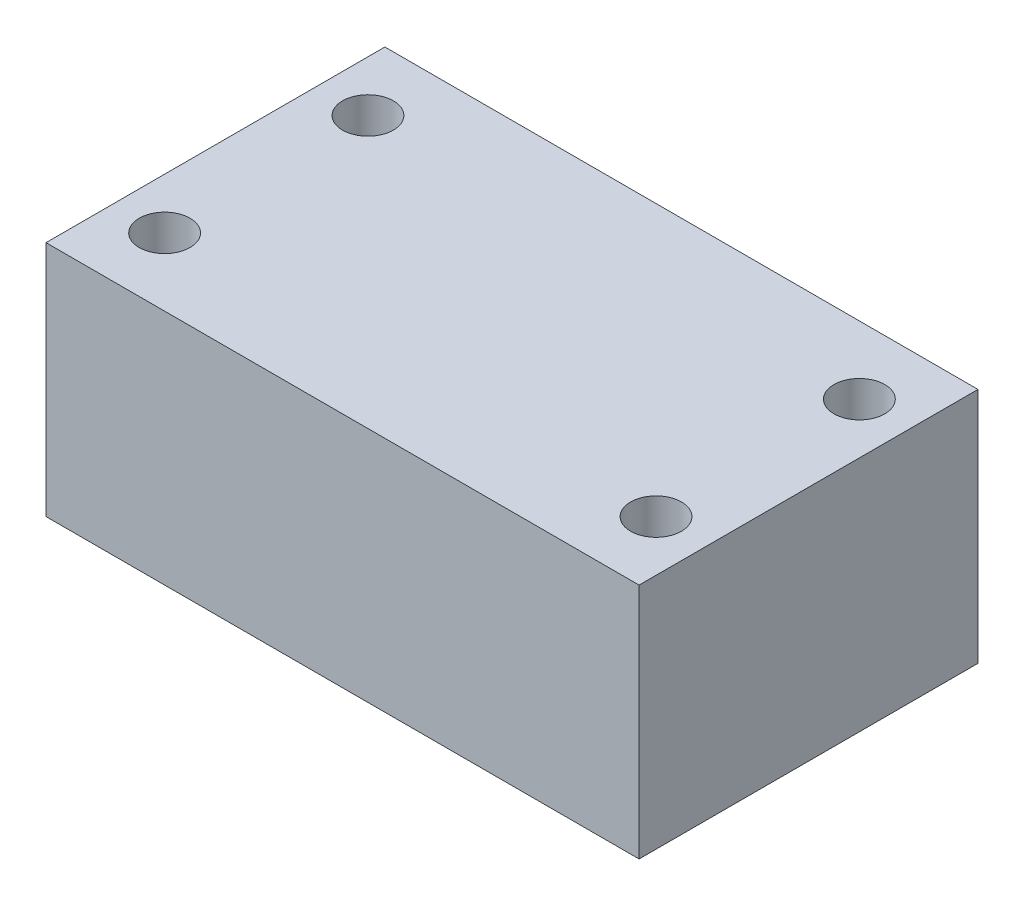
ISO-10303-21;
HEADER;
FILE_DESCRIPTION(('STEP AP214'),'2;1');
FILE_NAME('part.step','',(''),(''),'','','');
FILE_SCHEMA(('AUTOMOTIVE_DESIGN { 1 0 10303 214 1 1 1 1 }'));
ENDSEC;
DATA;
#1=APPLICATION_CONTEXT('core data for automotive mechanical design processes');
#2=APPLICATION_PROTOCOL_DEFINITION('international standard','automotive_design',2000,#1);
#3=PRODUCT_CONTEXT('',#1,'mechanical');
#4=PRODUCT('Part','Part','',(#3));
#5=PRODUCT_RELATED_PRODUCT_CATEGORY('part','',(#4));
#6=PRODUCT_DEFINITION_FORMATION('','',#4);
#7=PRODUCT_DEFINITION_CONTEXT('part definition',#1,'design');
#8=PRODUCT_DEFINITION('design','',#6,#7);
#9=PRODUCT_DEFINITION_SHAPE('','',#8);
#10=(LENGTH_UNIT() NAMED_UNIT(*) SI_UNIT(.MILLI.,.METRE.));
#11=(NAMED_UNIT(*) PLANE_ANGLE_UNIT() SI_UNIT($,.RADIAN.));
#12=(NAMED_UNIT(*) SI_UNIT($,.STERADIAN.) SOLID_ANGLE_UNIT());
#13=UNCERTAINTY_MEASURE_WITH_UNIT(LENGTH_MEASURE(1.E-05),#10,'distance_accuracy_value','');
#14=(GEOMETRIC_REPRESENTATION_CONTEXT(3) GLOBAL_UNCERTAINTY_ASSIGNED_CONTEXT((#13)) GLOBAL_UNIT_ASSIGNED_CONTEXT((#10,
#11,#12)) REPRESENTATION_CONTEXT('',''));
#15=CARTESIAN_POINT('',(0.,0.,0.));
#16=DIRECTION('',(0.,0.,1.));
#17=DIRECTION('',(1.,0.,0.));
#18=AXIS2_PLACEMENT_3D('',#15,#16,#17);
#19=CARTESIAN_POINT('',(0.,0.,0.));
#20=DIRECTION('',(0.,-1.,0.));
#21=DIRECTION('',(0.,0.,-1.));
#22=AXIS2_PLACEMENT_3D('',#19,#20,#21);
#23=PLANE('',#22);
#24=DIRECTION('',(0.,0.,-1.));
#25=VECTOR('',#24,1.);
#26=CARTESIAN_POINT('',(-35.,0.,20.));
#27=LINE('',#26,#25);
#28=CARTESIAN_POINT('',(-35.,0.,20.));
#29=VERTEX_POINT('',#28);
#30=CARTESIAN_POINT('',(-35.,0.,-20.));
#31=VERTEX_POINT('',#30);
#32=EDGE_CURVE('E55',#29,#31,#27,.T.);
#33=ORIENTED_EDGE('',*,*,#32,.T.);
#34=DIRECTION('',(1.,0.,0.));
#35=VECTOR('',#34,1.);
#36=CARTESIAN_POINT('',(-35.,0.,-20.));
#37=LINE('',#36,#35);
#38=CARTESIAN_POINT('',(35.,0.,-20.));
#39=VERTEX_POINT('',#38);
#40=EDGE_CURVE('E220',#31,#39,#37,.T.);
#41=ORIENTED_EDGE('',*,*,#40,.T.);
#42=DIRECTION('',(0.,0.,1.));
#43=VECTOR('',#42,1.);
#44=CARTESIAN_POINT('',(35.,0.,20.));
#45=LINE('',#44,#43);
#46=CARTESIAN_POINT('',(35.,0.,20.));
#47=VERTEX_POINT('',#46);
#48=EDGE_CURVE('E60',#39,#47,#45,.T.);
#49=ORIENTED_EDGE('',*,*,#48,.T.);
#50=DIRECTION('',(-1.,0.,0.));
#51=VECTOR('',#50,1.);
#52=CARTESIAN_POINT('',(-35.,0.,20.));
#53=LINE('',#52,#51);
#54=EDGE_CURVE('E58',#47,#29,#53,.T.);
#55=ORIENTED_EDGE('',*,*,#54,.T.);
#56=EDGE_LOOP('',(#33,#41,#49,#55));
#57=FACE_BOUND('',#56,.T.);
#58=CARTESIAN_POINT('',(-29.,0.,-12.));
#59=DIRECTION('',(0.,1.,0.));
#60=DIRECTION('',(0.,0.,1.));
#61=AXIS2_PLACEMENT_3D('',#58,#59,#60);
#62=CIRCLE('',#61,3.);
#63=CARTESIAN_POINT('',(-29.,0.,-9.));
#64=VERTEX_POINT('',#63);
#65=EDGE_CURVE('E66',#64,#64,#62,.T.);
#66=ORIENTED_EDGE('',*,*,#65,.T.);
#67=EDGE_LOOP('',(#66));
#68=FACE_BOUND('',#67,.T.);
#69=CARTESIAN_POINT('',(-29.,0.,12.));
#70=DIRECTION('',(0.,1.,0.));
#71=DIRECTION('',(0.,0.,1.));
#72=AXIS2_PLACEMENT_3D('',#69,#70,#71);
#73=CIRCLE('',#72,3.);
#74=CARTESIAN_POINT('',(-29.,0.,15.));
#75=VERTEX_POINT('',#74);
#76=EDGE_CURVE('E95',#75,#75,#73,.T.);
#77=ORIENTED_EDGE('',*,*,#76,.T.);
#78=EDGE_LOOP('',(#77));
#79=FACE_BOUND('',#78,.T.);
#80=CARTESIAN_POINT('',(29.,0.,-12.));
#81=DIRECTION('',(0.,1.,0.));
#82=DIRECTION('',(0.,0.,1.));
#83=AXIS2_PLACEMENT_3D('',#80,#81,#82);
#84=CIRCLE('',#83,3.);
#85=CARTESIAN_POINT('',(29.,0.,-9.));
#86=VERTEX_POINT('',#85);
#87=EDGE_CURVE('E97',#86,#86,#84,.T.);
#88=ORIENTED_EDGE('',*,*,#87,.T.);
#89=EDGE_LOOP('',(#88));
#90=FACE_BOUND('',#89,.T.);
#91=CARTESIAN_POINT('',(29.,0.,12.));
#92=DIRECTION('',(0.,1.,0.));
#93=DIRECTION('',(0.,0.,1.));
#94=AXIS2_PLACEMENT_3D('',#91,#92,#93);
#95=CIRCLE('',#94,3.);
#96=CARTESIAN_POINT('',(29.,0.,15.));
#97=VERTEX_POINT('',#96);
#98=EDGE_CURVE('E20',#97,#97,#95,.T.);
#99=ORIENTED_EDGE('',*,*,#98,.T.);
#100=EDGE_LOOP('',(#99));
#101=FACE_BOUND('',#100,.T.);
#102=ADVANCED_FACE('F17',(#57,#68,#79,#90,#101),#23,.T.);
#103=CARTESIAN_POINT('',(29.,0.,12.));
#104=DIRECTION('',(0.,1.,0.));
#105=DIRECTION('',(0.,0.,1.));
#106=AXIS2_PLACEMENT_3D('',#103,#104,#105);
#107=CYLINDRICAL_SURFACE('',#106,3.);
#108=ORIENTED_EDGE('',*,*,#98,.F.);
#109=EDGE_LOOP('',(#108));
#110=FACE_BOUND('',#109,.T.);
#111=CARTESIAN_POINT('',(29.,28.,12.));
#112=DIRECTION('',(0.,1.,0.));
#113=DIRECTION('',(0.,0.,1.));
#114=AXIS2_PLACEMENT_3D('',#111,#112,#113);
#115=CIRCLE('',#114,3.);
#116=CARTESIAN_POINT('',(29.,28.,15.));
#117=VERTEX_POINT('',#116);
#118=EDGE_CURVE('E90',#117,#117,#115,.T.);
#119=ORIENTED_EDGE('',*,*,#118,.T.);
#120=EDGE_LOOP('',(#119));
#121=FACE_BOUND('',#120,.T.);
#122=ADVANCED_FACE('F105',(#110,#121),#107,.F.);
#123=CARTESIAN_POINT('',(29.,0.,-12.));
#124=DIRECTION('',(0.,1.,0.));
#125=DIRECTION('',(0.,0.,1.));
#126=AXIS2_PLACEMENT_3D('',#123,#124,#125);
#127=CYLINDRICAL_SURFACE('',#126,3.);
#128=ORIENTED_EDGE('',*,*,#87,.F.);
#129=EDGE_LOOP('',(#128));
#130=FACE_BOUND('',#129,.T.);
#131=CARTESIAN_POINT('',(29.,28.,-12.));
#132=DIRECTION('',(0.,1.,0.));
#133=DIRECTION('',(0.,0.,1.));
#134=AXIS2_PLACEMENT_3D('',#131,#132,#133);
#135=CIRCLE('',#134,3.);
#136=CARTESIAN_POINT('',(29.,28.,-9.));
#137=VERTEX_POINT('',#136);
#138=EDGE_CURVE('E87',#137,#137,#135,.T.);
#139=ORIENTED_EDGE('',*,*,#138,.T.);
#140=EDGE_LOOP('',(#139));
#141=FACE_BOUND('',#140,.T.);
#142=ADVANCED_FACE('F108',(#130,#141),#127,.F.);
#143=CARTESIAN_POINT('',(-29.,0.,12.));
#144=DIRECTION('',(0.,1.,0.));
#145=DIRECTION('',(0.,0.,1.));
#146=AXIS2_PLACEMENT_3D('',#143,#144,#145);
#147=CYLINDRICAL_SURFACE('',#146,3.);
#148=ORIENTED_EDGE('',*,*,#76,.F.);
#149=EDGE_LOOP('',(#148));
#150=FACE_BOUND('',#149,.T.);
#151=CARTESIAN_POINT('',(-29.,28.,12.));
#152=DIRECTION('',(0.,1.,0.));
#153=DIRECTION('',(0.,0.,1.));
#154=AXIS2_PLACEMENT_3D('',#151,#152,#153);
#155=CIRCLE('',#154,3.);
#156=CARTESIAN_POINT('',(-29.,28.,15.));
#157=VERTEX_POINT('',#156);
#158=EDGE_CURVE('E84',#157,#157,#155,.T.);
#159=ORIENTED_EDGE('',*,*,#158,.T.);
#160=EDGE_LOOP('',(#159));
#161=FACE_BOUND('',#160,.T.);
#162=ADVANCED_FACE('F135',(#150,#161),#147,.F.);
#163=CARTESIAN_POINT('',(-29.,0.,-12.));
#164=DIRECTION('',(0.,1.,0.));
#165=DIRECTION('',(0.,0.,1.));
#166=AXIS2_PLACEMENT_3D('',#163,#164,#165);
#167=CYLINDRICAL_SURFACE('',#166,3.);
#168=ORIENTED_EDGE('',*,*,#65,.F.);
#169=EDGE_LOOP('',(#168));
#170=FACE_BOUND('',#169,.T.);
#171=CARTESIAN_POINT('',(-29.,28.,-12.));
#172=DIRECTION('',(0.,1.,0.));
#173=DIRECTION('',(0.,0.,1.));
#174=AXIS2_PLACEMENT_3D('',#171,#172,#173);
#175=CIRCLE('',#174,3.);
#176=CARTESIAN_POINT('',(-29.,28.,-9.));
#177=VERTEX_POINT('',#176);
#178=EDGE_CURVE('E81',#177,#177,#175,.T.);
#179=ORIENTED_EDGE('',*,*,#178,.T.);
#180=EDGE_LOOP('',(#179));
#181=FACE_BOUND('',#180,.T.);
#182=ADVANCED_FACE('F132',(#170,#181),#167,.F.);
#183=CARTESIAN_POINT('',(-35.,28.,20.));
#184=DIRECTION('',(0.,0.,-1.));
#185=DIRECTION('',(-1.,0.,0.));
#186=AXIS2_PLACEMENT_3D('',#183,#184,#185);
#187=PLANE('',#186);
#188=DIRECTION('',(0.,1.,0.));
#189=VECTOR('',#188,1.);
#190=CARTESIAN_POINT('',(35.,28.,20.));
#191=LINE('',#190,#189);
#192=CARTESIAN_POINT('',(35.,28.,20.));
#193=VERTEX_POINT('',#192);
#194=EDGE_CURVE('E228',#47,#193,#191,.T.);
#195=ORIENTED_EDGE('',*,*,#194,.T.);
#196=DIRECTION('',(1.,0.,0.));
#197=VECTOR('',#196,1.);
#198=CARTESIAN_POINT('',(0.,28.,20.));
#199=LINE('',#198,#197);
#200=CARTESIAN_POINT('',(-35.,28.,20.));
#201=VERTEX_POINT('',#200);
#202=EDGE_CURVE('E77',#193,#201,#199,.F.);
#203=ORIENTED_EDGE('',*,*,#202,.T.);
#204=DIRECTION('',(0.,1.,0.));
#205=VECTOR('',#204,1.);
#206=CARTESIAN_POINT('',(-35.,28.,20.));
#207=LINE('',#206,#205);
#208=EDGE_CURVE('E65',#201,#29,#207,.F.);
#209=ORIENTED_EDGE('',*,*,#208,.T.);
#210=ORIENTED_EDGE('',*,*,#54,.F.);
#211=EDGE_LOOP('',(#195,#203,#209,#210));
#212=FACE_BOUND('',#211,.T.);
#213=ADVANCED_FACE('F76',(#212),#187,.F.);
#214=CARTESIAN_POINT('',(-35.,28.,20.));
#215=DIRECTION('',(1.,0.,0.));
#216=DIRECTION('',(0.,0.,-1.));
#217=AXIS2_PLACEMENT_3D('',#214,#215,#216);
#218=PLANE('',#217);
#219=ORIENTED_EDGE('',*,*,#208,.F.);
#220=DIRECTION('',(0.,0.,-1.));
#221=VECTOR('',#220,1.);
#222=CARTESIAN_POINT('',(-35.,28.,0.));
#223=LINE('',#222,#221);
#224=CARTESIAN_POINT('',(-35.,28.,-20.));
#225=VERTEX_POINT('',#224);
#226=EDGE_CURVE('E221',#201,#225,#223,.T.);
#227=ORIENTED_EDGE('',*,*,#226,.T.);
#228=DIRECTION('',(0.,1.,0.));
#229=VECTOR('',#228,1.);
#230=CARTESIAN_POINT('',(-35.,28.,-20.));
#231=LINE('',#230,#229);
#232=EDGE_CURVE('E73',#225,#31,#231,.F.);
#233=ORIENTED_EDGE('',*,*,#232,.T.);
#234=ORIENTED_EDGE('',*,*,#32,.F.);
#235=EDGE_LOOP('',(#219,#227,#233,#234));
#236=FACE_BOUND('',#235,.T.);
#237=ADVANCED_FACE('F70',(#236),#218,.F.);
#238=CARTESIAN_POINT('',(-35.,28.,-20.));
#239=DIRECTION('',(0.,0.,1.));
#240=DIRECTION('',(1.,0.,0.));
#241=AXIS2_PLACEMENT_3D('',#238,#239,#240);
#242=PLANE('',#241);
#243=ORIENTED_EDGE('',*,*,#232,.F.);
#244=DIRECTION('',(1.,0.,0.));
#245=VECTOR('',#244,1.);
#246=CARTESIAN_POINT('',(0.,28.,-20.));
#247=LINE('',#246,#245);
#248=CARTESIAN_POINT('',(35.,28.,-20.));
#249=VERTEX_POINT('',#248);
#250=EDGE_CURVE('E26',#225,#249,#247,.T.);
#251=ORIENTED_EDGE('',*,*,#250,.T.);
#252=DIRECTION('',(0.,1.,0.));
#253=VECTOR('',#252,1.);
#254=CARTESIAN_POINT('',(35.,28.,-20.));
#255=LINE('',#254,#253);
#256=EDGE_CURVE('E34',#249,#39,#255,.F.);
#257=ORIENTED_EDGE('',*,*,#256,.T.);
#258=ORIENTED_EDGE('',*,*,#40,.F.);
#259=EDGE_LOOP('',(#243,#251,#257,#258));
#260=FACE_BOUND('',#259,.T.);
#261=ADVANCED_FACE('F120',(#260),#242,.F.);
#262=CARTESIAN_POINT('',(35.,28.,20.));
#263=DIRECTION('',(-1.,0.,0.));
#264=DIRECTION('',(0.,0.,1.));
#265=AXIS2_PLACEMENT_3D('',#262,#263,#264);
#266=PLANE('',#265);
#267=ORIENTED_EDGE('',*,*,#256,.F.);
#268=DIRECTION('',(0.,0.,-1.));
#269=VECTOR('',#268,1.);
#270=CARTESIAN_POINT('',(35.,28.,0.));
#271=LINE('',#270,#269);
#272=EDGE_CURVE('E11',#249,#193,#271,.F.);
#273=ORIENTED_EDGE('',*,*,#272,.T.);
#274=ORIENTED_EDGE('',*,*,#194,.F.);
#275=ORIENTED_EDGE('',*,*,#48,.F.);
#276=EDGE_LOOP('',(#267,#273,#274,#275));
#277=FACE_BOUND('',#276,.T.);
#278=ADVANCED_FACE('F113',(#277),#266,.F.);
#279=CARTESIAN_POINT('',(0.,28.,0.));
#280=DIRECTION('',(0.,-1.,0.));
#281=DIRECTION('',(0.,0.,-1.));
#282=AXIS2_PLACEMENT_3D('',#279,#280,#281);
#283=PLANE('',#282);
#284=ORIENTED_EDGE('',*,*,#250,.F.);
#285=ORIENTED_EDGE('',*,*,#226,.F.);
#286=ORIENTED_EDGE('',*,*,#202,.F.);
#287=ORIENTED_EDGE('',*,*,#272,.F.);
#288=EDGE_LOOP('',(#284,#285,#286,#287));
#289=FACE_BOUND('',#288,.T.);
#290=ORIENTED_EDGE('',*,*,#178,.F.);
#291=EDGE_LOOP('',(#290));
#292=FACE_BOUND('',#291,.T.);
#293=ORIENTED_EDGE('',*,*,#158,.F.);
#294=EDGE_LOOP('',(#293));
#295=FACE_BOUND('',#294,.T.);
#296=ORIENTED_EDGE('',*,*,#138,.F.);
#297=EDGE_LOOP('',(#296));
#298=FACE_BOUND('',#297,.T.);
#299=ORIENTED_EDGE('',*,*,#118,.F.);
#300=EDGE_LOOP('',(#299));
#301=FACE_BOUND('',#300,.T.);
#302=ADVANCED_FACE('F111',(#289,#292,#295,#298,#301),#283,.F.);
#303=CLOSED_SHELL('',(#102,#122,#142,#162,#182,#213,#237,#261,#278,#302));
#304=MANIFOLD_SOLID_BREP('B1',#303);
#305=ADVANCED_BREP_SHAPE_REPRESENTATION('',(#18,#304),#14);
#306=SHAPE_DEFINITION_REPRESENTATION(#9,#305);
ENDSEC;
END-ISO-10303-21;
